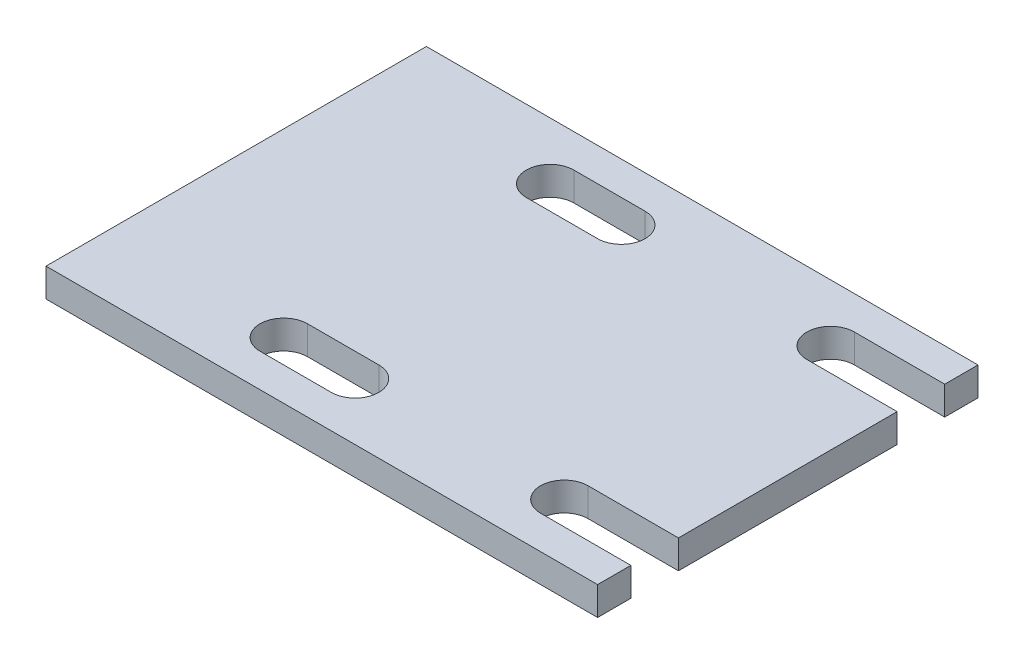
ISO-10303-21;
HEADER;
FILE_DESCRIPTION(('STEP AP214'),'2;1');
FILE_NAME('part.step','',(''),(''),'','','');
FILE_SCHEMA(('AUTOMOTIVE_DESIGN { 1 0 10303 214 1 1 1 1 }'));
ENDSEC;
DATA;
#1=APPLICATION_CONTEXT('core data for automotive mechanical design processes');
#2=APPLICATION_PROTOCOL_DEFINITION('international standard','automotive_design',2000,#1);
#3=PRODUCT_CONTEXT('',#1,'mechanical');
#4=PRODUCT('Part','Part','',(#3));
#5=PRODUCT_RELATED_PRODUCT_CATEGORY('part','',(#4));
#6=PRODUCT_DEFINITION_FORMATION('','',#4);
#7=PRODUCT_DEFINITION_CONTEXT('part definition',#1,'design');
#8=PRODUCT_DEFINITION('design','',#6,#7);
#9=PRODUCT_DEFINITION_SHAPE('','',#8);
#10=(LENGTH_UNIT() NAMED_UNIT(*) SI_UNIT(.MILLI.,.METRE.));
#11=(NAMED_UNIT(*) PLANE_ANGLE_UNIT() SI_UNIT($,.RADIAN.));
#12=(NAMED_UNIT(*) SI_UNIT($,.STERADIAN.) SOLID_ANGLE_UNIT());
#13=UNCERTAINTY_MEASURE_WITH_UNIT(LENGTH_MEASURE(1.E-05),#10,'distance_accuracy_value','');
#14=(GEOMETRIC_REPRESENTATION_CONTEXT(3) GLOBAL_UNCERTAINTY_ASSIGNED_CONTEXT((#13)) GLOBAL_UNIT_ASSIGNED_CONTEXT((#10,
#11,#12)) REPRESENTATION_CONTEXT('',''));
#15=CARTESIAN_POINT('',(0.,0.,0.));
#16=DIRECTION('',(0.,0.,1.));
#17=DIRECTION('',(1.,0.,0.));
#18=AXIS2_PLACEMENT_3D('',#15,#16,#17);
#19=CARTESIAN_POINT('',(368.3,19.05,0.));
#20=DIRECTION('',(-1.,0.,0.));
#21=DIRECTION('',(0.,0.,1.));
#22=AXIS2_PLACEMENT_3D('',#19,#20,#21);
#23=PLANE('',#22);
#24=DIRECTION('',(0.,0.,-1.));
#25=VECTOR('',#24,1.);
#26=CARTESIAN_POINT('',(368.3,19.05,0.));
#27=LINE('',#26,#25);
#28=CARTESIAN_POINT('',(368.3,19.05,-53.975));
#29=VERTEX_POINT('',#28);
#30=CARTESIAN_POINT('',(368.3,19.05,-200.025));
#31=VERTEX_POINT('',#30);
#32=EDGE_CURVE('E358',#29,#31,#27,.T.);
#33=ORIENTED_EDGE('',*,*,#32,.F.);
#34=DIRECTION('',(0.,1.,0.));
#35=VECTOR('',#34,1.);
#36=CARTESIAN_POINT('',(368.3,0.,-53.975));
#37=LINE('',#36,#35);
#38=CARTESIAN_POINT('',(368.3,0.,-53.975));
#39=VERTEX_POINT('',#38);
#40=EDGE_CURVE('E219',#39,#29,#37,.T.);
#41=ORIENTED_EDGE('',*,*,#40,.F.);
#42=DIRECTION('',(0.,0.,-1.));
#43=VECTOR('',#42,1.);
#44=CARTESIAN_POINT('',(368.3,0.,0.));
#45=LINE('',#44,#43);
#46=CARTESIAN_POINT('',(368.3,0.,-200.025));
#47=VERTEX_POINT('',#46);
#48=EDGE_CURVE('E372',#39,#47,#45,.T.);
#49=ORIENTED_EDGE('',*,*,#48,.T.);
#50=DIRECTION('',(0.,1.,0.));
#51=VECTOR('',#50,1.);
#52=CARTESIAN_POINT('',(368.3,0.,-200.025));
#53=LINE('',#52,#51);
#54=EDGE_CURVE('E55',#47,#31,#53,.T.);
#55=ORIENTED_EDGE('',*,*,#54,.T.);
#56=EDGE_LOOP('',(#33,#41,#49,#55));
#57=FACE_BOUND('',#56,.T.);
#58=ADVANCED_FACE('F39',(#57),#23,.F.);
#59=CARTESIAN_POINT('',(368.3,19.05,-231.775));
#60=VERTEX_POINT('',#59);
#61=CARTESIAN_POINT('',(368.3,19.05,-254.));
#62=VERTEX_POINT('',#61);
#63=EDGE_CURVE('E352',#60,#62,#27,.T.);
#64=ORIENTED_EDGE('',*,*,#63,.F.);
#65=DIRECTION('',(0.,1.,0.));
#66=VECTOR('',#65,1.);
#67=CARTESIAN_POINT('',(368.3,0.,-231.775));
#68=LINE('',#67,#66);
#69=CARTESIAN_POINT('',(368.3,0.,-231.775));
#70=VERTEX_POINT('',#69);
#71=EDGE_CURVE('E249',#70,#60,#68,.T.);
#72=ORIENTED_EDGE('',*,*,#71,.F.);
#73=CARTESIAN_POINT('',(368.3,0.,-254.));
#74=VERTEX_POINT('',#73);
#75=EDGE_CURVE('E368',#70,#74,#45,.T.);
#76=ORIENTED_EDGE('',*,*,#75,.T.);
#77=DIRECTION('',(0.,-1.,0.));
#78=VECTOR('',#77,1.);
#79=CARTESIAN_POINT('',(368.3,19.05,-254.));
#80=LINE('',#79,#78);
#81=EDGE_CURVE('E378',#62,#74,#80,.T.);
#82=ORIENTED_EDGE('',*,*,#81,.F.);
#83=EDGE_LOOP('',(#64,#72,#76,#82));
#84=FACE_BOUND('',#83,.T.);
#85=ADVANCED_FACE('F422',(#84),#23,.F.);
#86=CARTESIAN_POINT('',(0.,19.05,0.));
#87=DIRECTION('',(1.,0.,0.));
#88=DIRECTION('',(0.,0.,-1.));
#89=AXIS2_PLACEMENT_3D('',#86,#87,#88);
#90=PLANE('',#89);
#91=DIRECTION('',(0.,0.,1.));
#92=VECTOR('',#91,1.);
#93=CARTESIAN_POINT('',(0.,0.,0.));
#94=LINE('',#93,#92);
#95=CARTESIAN_POINT('',(0.,0.,-254.));
#96=VERTEX_POINT('',#95);
#97=CARTESIAN_POINT('',(0.,0.,0.));
#98=VERTEX_POINT('',#97);
#99=EDGE_CURVE('E292',#96,#98,#94,.T.);
#100=ORIENTED_EDGE('',*,*,#99,.T.);
#101=DIRECTION('',(0.,-1.,0.));
#102=VECTOR('',#101,1.);
#103=CARTESIAN_POINT('',(0.,19.05,0.));
#104=LINE('',#103,#102);
#105=CARTESIAN_POINT('',(0.,19.05,0.));
#106=VERTEX_POINT('',#105);
#107=EDGE_CURVE('E11',#106,#98,#104,.T.);
#108=ORIENTED_EDGE('',*,*,#107,.F.);
#109=DIRECTION('',(0.,0.,1.));
#110=VECTOR('',#109,1.);
#111=CARTESIAN_POINT('',(0.,19.05,0.));
#112=LINE('',#111,#110);
#113=CARTESIAN_POINT('',(0.,19.05,-254.));
#114=VERTEX_POINT('',#113);
#115=EDGE_CURVE('E344',#114,#106,#112,.T.);
#116=ORIENTED_EDGE('',*,*,#115,.F.);
#117=DIRECTION('',(0.,-1.,0.));
#118=VECTOR('',#117,1.);
#119=CARTESIAN_POINT('',(0.,19.05,-254.));
#120=LINE('',#119,#118);
#121=EDGE_CURVE('E361',#114,#96,#120,.T.);
#122=ORIENTED_EDGE('',*,*,#121,.T.);
#123=EDGE_LOOP('',(#100,#108,#116,#122));
#124=FACE_BOUND('',#123,.T.);
#125=ADVANCED_FACE('F41',(#124),#90,.F.);
#126=CARTESIAN_POINT('',(0.,19.05,0.));
#127=DIRECTION('',(0.,0.,-1.));
#128=DIRECTION('',(-1.,0.,0.));
#129=AXIS2_PLACEMENT_3D('',#126,#127,#128);
#130=PLANE('',#129);
#131=DIRECTION('',(1.,0.,0.));
#132=VECTOR('',#131,1.);
#133=CARTESIAN_POINT('',(0.,0.,0.));
#134=LINE('',#133,#132);
#135=CARTESIAN_POINT('',(368.3,0.,0.));
#136=VERTEX_POINT('',#135);
#137=EDGE_CURVE('E365',#98,#136,#134,.T.);
#138=ORIENTED_EDGE('',*,*,#137,.T.);
#139=DIRECTION('',(0.,-1.,0.));
#140=VECTOR('',#139,1.);
#141=CARTESIAN_POINT('',(368.3,19.05,0.));
#142=LINE('',#141,#140);
#143=CARTESIAN_POINT('',(368.3,19.05,0.));
#144=VERTEX_POINT('',#143);
#145=EDGE_CURVE('E48',#144,#136,#142,.T.);
#146=ORIENTED_EDGE('',*,*,#145,.F.);
#147=DIRECTION('',(1.,0.,0.));
#148=VECTOR('',#147,1.);
#149=CARTESIAN_POINT('',(0.,19.05,0.));
#150=LINE('',#149,#148);
#151=EDGE_CURVE('E348',#106,#144,#150,.T.);
#152=ORIENTED_EDGE('',*,*,#151,.F.);
#153=ORIENTED_EDGE('',*,*,#107,.T.);
#154=EDGE_LOOP('',(#138,#146,#152,#153));
#155=FACE_BOUND('',#154,.T.);
#156=ADVANCED_FACE('F391',(#155),#130,.F.);
#157=CARTESIAN_POINT('',(368.3,0.,-22.225));
#158=VERTEX_POINT('',#157);
#159=EDGE_CURVE('E369',#136,#158,#45,.T.);
#160=ORIENTED_EDGE('',*,*,#159,.T.);
#161=DIRECTION('',(0.,1.,0.));
#162=VECTOR('',#161,1.);
#163=CARTESIAN_POINT('',(368.3,0.,-22.225));
#164=LINE('',#163,#162);
#165=CARTESIAN_POINT('',(368.3,19.05,-22.225));
#166=VERTEX_POINT('',#165);
#167=EDGE_CURVE('E63',#158,#166,#164,.T.);
#168=ORIENTED_EDGE('',*,*,#167,.T.);
#169=EDGE_CURVE('E353',#144,#166,#27,.T.);
#170=ORIENTED_EDGE('',*,*,#169,.F.);
#171=ORIENTED_EDGE('',*,*,#145,.T.);
#172=EDGE_LOOP('',(#160,#168,#170,#171));
#173=FACE_BOUND('',#172,.T.);
#174=ADVANCED_FACE('F386',(#173),#23,.F.);
#175=CARTESIAN_POINT('',(0.,19.05,-254.));
#176=DIRECTION('',(0.,0.,1.));
#177=DIRECTION('',(1.,0.,0.));
#178=AXIS2_PLACEMENT_3D('',#175,#176,#177);
#179=PLANE('',#178);
#180=DIRECTION('',(-1.,0.,0.));
#181=VECTOR('',#180,1.);
#182=CARTESIAN_POINT('',(0.,0.,-254.));
#183=LINE('',#182,#181);
#184=EDGE_CURVE('E349',#74,#96,#183,.T.);
#185=ORIENTED_EDGE('',*,*,#184,.T.);
#186=ORIENTED_EDGE('',*,*,#121,.F.);
#187=DIRECTION('',(-1.,0.,0.));
#188=VECTOR('',#187,1.);
#189=CARTESIAN_POINT('',(0.,19.05,-254.));
#190=LINE('',#189,#188);
#191=EDGE_CURVE('E357',#62,#114,#190,.T.);
#192=ORIENTED_EDGE('',*,*,#191,.F.);
#193=ORIENTED_EDGE('',*,*,#81,.T.);
#194=EDGE_LOOP('',(#185,#186,#192,#193));
#195=FACE_BOUND('',#194,.T.);
#196=ADVANCED_FACE('F397',(#195),#179,.F.);
#197=CARTESIAN_POINT('',(0.,19.05,0.));
#198=DIRECTION('',(0.,-1.,0.));
#199=DIRECTION('',(0.,0.,-1.));
#200=AXIS2_PLACEMENT_3D('',#197,#198,#199);
#201=PLANE('',#200);
#202=DIRECTION('',(1.,0.,0.));
#203=VECTOR('',#202,1.);
#204=CARTESIAN_POINT('',(168.275,19.05,-22.225));
#205=LINE('',#204,#203);
#206=CARTESIAN_POINT('',(120.65,19.05,-22.225));
#207=VERTEX_POINT('',#206);
#208=CARTESIAN_POINT('',(168.275,19.05,-22.225));
#209=VERTEX_POINT('',#208);
#210=EDGE_CURVE('E277',#207,#209,#205,.T.);
#211=ORIENTED_EDGE('',*,*,#210,.F.);
#212=CARTESIAN_POINT('',(120.65,19.05,-38.1));
#213=DIRECTION('',(0.,1.,0.));
#214=DIRECTION('',(0.,0.,1.));
#215=AXIS2_PLACEMENT_3D('',#212,#213,#214);
#216=CIRCLE('',#215,15.875);
#217=CARTESIAN_POINT('',(120.65,19.05,-53.975));
#218=VERTEX_POINT('',#217);
#219=EDGE_CURVE('E274',#218,#207,#216,.T.);
#220=ORIENTED_EDGE('',*,*,#219,.F.);
#221=DIRECTION('',(-1.,0.,0.));
#222=VECTOR('',#221,1.);
#223=CARTESIAN_POINT('',(120.65,19.05,-53.975));
#224=LINE('',#223,#222);
#225=CARTESIAN_POINT('',(168.275,19.05,-53.975));
#226=VERTEX_POINT('',#225);
#227=EDGE_CURVE('E261',#226,#218,#224,.T.);
#228=ORIENTED_EDGE('',*,*,#227,.F.);
#229=CARTESIAN_POINT('',(168.275,19.05,-38.1));
#230=DIRECTION('',(0.,1.,0.));
#231=DIRECTION('',(0.,0.,1.));
#232=AXIS2_PLACEMENT_3D('',#229,#230,#231);
#233=CIRCLE('',#232,15.875);
#234=EDGE_CURVE('E282',#209,#226,#233,.T.);
#235=ORIENTED_EDGE('',*,*,#234,.F.);
#236=EDGE_LOOP('',(#211,#220,#228,#235));
#237=FACE_BOUND('',#236,.T.);
#238=DIRECTION('',(1.,0.,0.));
#239=VECTOR('',#238,1.);
#240=CARTESIAN_POINT('',(120.65,19.05,-200.025));
#241=LINE('',#240,#239);
#242=CARTESIAN_POINT('',(120.65,19.05,-200.025));
#243=VERTEX_POINT('',#242);
#244=CARTESIAN_POINT('',(168.275,19.05,-200.025));
#245=VERTEX_POINT('',#244);
#246=EDGE_CURVE('E322',#243,#245,#241,.T.);
#247=ORIENTED_EDGE('',*,*,#246,.F.);
#248=CARTESIAN_POINT('',(120.65,19.05,-215.9));
#249=DIRECTION('',(0.,1.,0.));
#250=DIRECTION('',(0.,0.,-1.));
#251=AXIS2_PLACEMENT_3D('',#248,#249,#250);
#252=CIRCLE('',#251,15.875);
#253=CARTESIAN_POINT('',(120.65,19.05,-231.775));
#254=VERTEX_POINT('',#253);
#255=EDGE_CURVE('E218',#254,#243,#252,.T.);
#256=ORIENTED_EDGE('',*,*,#255,.F.);
#257=DIRECTION('',(-1.,0.,0.));
#258=VECTOR('',#257,1.);
#259=CARTESIAN_POINT('',(168.275,19.05,-231.775));
#260=LINE('',#259,#258);
#261=CARTESIAN_POINT('',(168.275,19.05,-231.775));
#262=VERTEX_POINT('',#261);
#263=EDGE_CURVE('E307',#262,#254,#260,.T.);
#264=ORIENTED_EDGE('',*,*,#263,.F.);
#265=CARTESIAN_POINT('',(168.275,19.05,-215.9));
#266=DIRECTION('',(0.,1.,0.));
#267=DIRECTION('',(0.,0.,-1.));
#268=AXIS2_PLACEMENT_3D('',#265,#266,#267);
#269=CIRCLE('',#268,15.875);
#270=EDGE_CURVE('E326',#245,#262,#269,.T.);
#271=ORIENTED_EDGE('',*,*,#270,.F.);
#272=EDGE_LOOP('',(#247,#256,#264,#271));
#273=FACE_BOUND('',#272,.T.);
#274=CARTESIAN_POINT('',(307.975,19.05,-38.1));
#275=DIRECTION('',(0.,1.,0.));
#276=DIRECTION('',(0.,0.,1.));
#277=AXIS2_PLACEMENT_3D('',#274,#275,#276);
#278=CIRCLE('',#277,15.875);
#279=CARTESIAN_POINT('',(307.975,19.05,-53.975));
#280=VERTEX_POINT('',#279);
#281=CARTESIAN_POINT('',(307.975,19.05,-22.225));
#282=VERTEX_POINT('',#281);
#283=EDGE_CURVE('E185',#280,#282,#278,.T.);
#284=ORIENTED_EDGE('',*,*,#283,.F.);
#285=DIRECTION('',(-1.,0.,0.));
#286=VECTOR('',#285,1.);
#287=CARTESIAN_POINT('',(307.975,19.05,-53.975));
#288=LINE('',#287,#286);
#289=EDGE_CURVE('E201',#29,#280,#288,.T.);
#290=ORIENTED_EDGE('',*,*,#289,.F.);
#291=ORIENTED_EDGE('',*,*,#32,.T.);
#292=DIRECTION('',(1.,0.,0.));
#293=VECTOR('',#292,1.);
#294=CARTESIAN_POINT('',(307.975,19.05,-200.025));
#295=LINE('',#294,#293);
#296=CARTESIAN_POINT('',(307.975,19.05,-200.025));
#297=VERTEX_POINT('',#296);
#298=EDGE_CURVE('E241',#297,#31,#295,.T.);
#299=ORIENTED_EDGE('',*,*,#298,.F.);
#300=CARTESIAN_POINT('',(307.975,19.05,-215.9));
#301=DIRECTION('',(0.,1.,0.));
#302=DIRECTION('',(0.,0.,-1.));
#303=AXIS2_PLACEMENT_3D('',#300,#301,#302);
#304=CIRCLE('',#303,15.875);
#305=CARTESIAN_POINT('',(307.975,19.05,-231.775));
#306=VERTEX_POINT('',#305);
#307=EDGE_CURVE('E237',#306,#297,#304,.T.);
#308=ORIENTED_EDGE('',*,*,#307,.F.);
#309=DIRECTION('',(-1.,0.,0.));
#310=VECTOR('',#309,1.);
#311=CARTESIAN_POINT('',(307.975,19.05,-231.775));
#312=LINE('',#311,#310);
#313=EDGE_CURVE('E229',#60,#306,#312,.T.);
#314=ORIENTED_EDGE('',*,*,#313,.F.);
#315=ORIENTED_EDGE('',*,*,#63,.T.);
#316=ORIENTED_EDGE('',*,*,#191,.T.);
#317=ORIENTED_EDGE('',*,*,#115,.T.);
#318=ORIENTED_EDGE('',*,*,#151,.T.);
#319=ORIENTED_EDGE('',*,*,#169,.T.);
#320=DIRECTION('',(1.,0.,0.));
#321=VECTOR('',#320,1.);
#322=CARTESIAN_POINT('',(307.975,19.05,-22.225));
#323=LINE('',#322,#321);
#324=EDGE_CURVE('E205',#282,#166,#323,.T.);
#325=ORIENTED_EDGE('',*,*,#324,.F.);
#326=EDGE_LOOP('',(#284,#290,#291,#299,#308,#314,#315,#316,#317,#318,#319,#325));
#327=FACE_BOUND('',#326,.T.);
#328=ADVANCED_FACE('F417',(#237,#273,#327),#201,.F.);
#329=CARTESIAN_POINT('',(0.,0.,0.));
#330=DIRECTION('',(0.,-1.,0.));
#331=DIRECTION('',(0.,0.,-1.));
#332=AXIS2_PLACEMENT_3D('',#329,#330,#331);
#333=PLANE('',#332);
#334=DIRECTION('',(-1.,0.,0.));
#335=VECTOR('',#334,1.);
#336=CARTESIAN_POINT('',(307.975,0.,-53.975));
#337=LINE('',#336,#335);
#338=CARTESIAN_POINT('',(307.975,0.,-53.975));
#339=VERTEX_POINT('',#338);
#340=EDGE_CURVE('E188',#39,#339,#337,.T.);
#341=ORIENTED_EDGE('',*,*,#340,.T.);
#342=CARTESIAN_POINT('',(307.975,0.,-38.1));
#343=DIRECTION('',(0.,1.,0.));
#344=DIRECTION('',(0.,0.,1.));
#345=AXIS2_PLACEMENT_3D('',#342,#343,#344);
#346=CIRCLE('',#345,15.875);
#347=CARTESIAN_POINT('',(307.975,0.,-22.225));
#348=VERTEX_POINT('',#347);
#349=EDGE_CURVE('E182',#339,#348,#346,.T.);
#350=ORIENTED_EDGE('',*,*,#349,.T.);
#351=DIRECTION('',(1.,0.,0.));
#352=VECTOR('',#351,1.);
#353=CARTESIAN_POINT('',(307.975,0.,-22.225));
#354=LINE('',#353,#352);
#355=EDGE_CURVE('E190',#348,#158,#354,.T.);
#356=ORIENTED_EDGE('',*,*,#355,.T.);
#357=ORIENTED_EDGE('',*,*,#159,.F.);
#358=ORIENTED_EDGE('',*,*,#137,.F.);
#359=ORIENTED_EDGE('',*,*,#99,.F.);
#360=ORIENTED_EDGE('',*,*,#184,.F.);
#361=ORIENTED_EDGE('',*,*,#75,.F.);
#362=DIRECTION('',(-1.,0.,0.));
#363=VECTOR('',#362,1.);
#364=CARTESIAN_POINT('',(307.975,0.,-231.775));
#365=LINE('',#364,#363);
#366=CARTESIAN_POINT('',(307.975,0.,-231.775));
#367=VERTEX_POINT('',#366);
#368=EDGE_CURVE('E232',#70,#367,#365,.T.);
#369=ORIENTED_EDGE('',*,*,#368,.T.);
#370=CARTESIAN_POINT('',(307.975,0.,-215.9));
#371=DIRECTION('',(0.,1.,0.));
#372=DIRECTION('',(0.,0.,-1.));
#373=AXIS2_PLACEMENT_3D('',#370,#371,#372);
#374=CIRCLE('',#373,15.875);
#375=CARTESIAN_POINT('',(307.975,0.,-200.025));
#376=VERTEX_POINT('',#375);
#377=EDGE_CURVE('E224',#367,#376,#374,.T.);
#378=ORIENTED_EDGE('',*,*,#377,.T.);
#379=DIRECTION('',(1.,0.,0.));
#380=VECTOR('',#379,1.);
#381=CARTESIAN_POINT('',(307.975,0.,-200.025));
#382=LINE('',#381,#380);
#383=EDGE_CURVE('E228',#376,#47,#382,.T.);
#384=ORIENTED_EDGE('',*,*,#383,.T.);
#385=ORIENTED_EDGE('',*,*,#48,.F.);
#386=EDGE_LOOP('',(#341,#350,#356,#357,#358,#359,#360,#361,#369,#378,#384,#385));
#387=FACE_BOUND('',#386,.T.);
#388=CARTESIAN_POINT('',(120.65,0.,-38.1));
#389=DIRECTION('',(0.,1.,0.));
#390=DIRECTION('',(0.,0.,1.));
#391=AXIS2_PLACEMENT_3D('',#388,#389,#390);
#392=CIRCLE('',#391,15.875);
#393=CARTESIAN_POINT('',(120.65,0.,-53.975));
#394=VERTEX_POINT('',#393);
#395=CARTESIAN_POINT('',(120.65,0.,-22.225));
#396=VERTEX_POINT('',#395);
#397=EDGE_CURVE('E256',#394,#396,#392,.T.);
#398=ORIENTED_EDGE('',*,*,#397,.T.);
#399=DIRECTION('',(1.,0.,0.));
#400=VECTOR('',#399,1.);
#401=CARTESIAN_POINT('',(168.275,0.,-22.225));
#402=LINE('',#401,#400);
#403=CARTESIAN_POINT('',(168.275,0.,-22.225));
#404=VERTEX_POINT('',#403);
#405=EDGE_CURVE('E260',#396,#404,#402,.T.);
#406=ORIENTED_EDGE('',*,*,#405,.T.);
#407=CARTESIAN_POINT('',(168.275,0.,-38.1));
#408=DIRECTION('',(0.,1.,0.));
#409=DIRECTION('',(0.,0.,1.));
#410=AXIS2_PLACEMENT_3D('',#407,#408,#409);
#411=CIRCLE('',#410,15.875);
#412=CARTESIAN_POINT('',(168.275,0.,-53.975));
#413=VERTEX_POINT('',#412);
#414=EDGE_CURVE('E265',#404,#413,#411,.T.);
#415=ORIENTED_EDGE('',*,*,#414,.T.);
#416=DIRECTION('',(-1.,0.,0.));
#417=VECTOR('',#416,1.);
#418=CARTESIAN_POINT('',(120.65,0.,-53.975));
#419=LINE('',#418,#417);
#420=EDGE_CURVE('E269',#413,#394,#419,.T.);
#421=ORIENTED_EDGE('',*,*,#420,.T.);
#422=EDGE_LOOP('',(#398,#406,#415,#421));
#423=FACE_BOUND('',#422,.T.);
#424=CARTESIAN_POINT('',(120.65,0.,-215.9));
#425=DIRECTION('',(0.,1.,0.));
#426=DIRECTION('',(0.,0.,-1.));
#427=AXIS2_PLACEMENT_3D('',#424,#425,#426);
#428=CIRCLE('',#427,15.875);
#429=CARTESIAN_POINT('',(120.65,0.,-231.775));
#430=VERTEX_POINT('',#429);
#431=CARTESIAN_POINT('',(120.65,0.,-200.025));
#432=VERTEX_POINT('',#431);
#433=EDGE_CURVE('E302',#430,#432,#428,.T.);
#434=ORIENTED_EDGE('',*,*,#433,.T.);
#435=DIRECTION('',(1.,0.,0.));
#436=VECTOR('',#435,1.);
#437=CARTESIAN_POINT('',(120.65,0.,-200.025));
#438=LINE('',#437,#436);
#439=CARTESIAN_POINT('',(168.275,0.,-200.025));
#440=VERTEX_POINT('',#439);
#441=EDGE_CURVE('E306',#432,#440,#438,.T.);
#442=ORIENTED_EDGE('',*,*,#441,.T.);
#443=CARTESIAN_POINT('',(168.275,0.,-215.9));
#444=DIRECTION('',(0.,1.,0.));
#445=DIRECTION('',(0.,0.,-1.));
#446=AXIS2_PLACEMENT_3D('',#443,#444,#445);
#447=CIRCLE('',#446,15.875);
#448=CARTESIAN_POINT('',(168.275,0.,-231.775));
#449=VERTEX_POINT('',#448);
#450=EDGE_CURVE('E311',#440,#449,#447,.T.);
#451=ORIENTED_EDGE('',*,*,#450,.T.);
#452=DIRECTION('',(-1.,0.,0.));
#453=VECTOR('',#452,1.);
#454=CARTESIAN_POINT('',(168.275,0.,-231.775));
#455=LINE('',#454,#453);
#456=EDGE_CURVE('E315',#449,#430,#455,.T.);
#457=ORIENTED_EDGE('',*,*,#456,.T.);
#458=EDGE_LOOP('',(#434,#442,#451,#457));
#459=FACE_BOUND('',#458,.T.);
#460=ADVANCED_FACE('F197',(#387,#423,#459),#333,.T.);
#461=CARTESIAN_POINT('',(120.65,0.,-215.9));
#462=DIRECTION('',(0.,1.,0.));
#463=DIRECTION('',(0.,0.,1.));
#464=AXIS2_PLACEMENT_3D('',#461,#462,#463);
#465=CYLINDRICAL_SURFACE('',#464,15.875);
#466=ORIENTED_EDGE('',*,*,#255,.T.);
#467=DIRECTION('',(0.,1.,0.));
#468=VECTOR('',#467,1.);
#469=CARTESIAN_POINT('',(120.65,0.,-200.025));
#470=LINE('',#469,#468);
#471=EDGE_CURVE('E319',#432,#243,#470,.T.);
#472=ORIENTED_EDGE('',*,*,#471,.F.);
#473=ORIENTED_EDGE('',*,*,#433,.F.);
#474=DIRECTION('',(0.,1.,0.));
#475=VECTOR('',#474,1.);
#476=CARTESIAN_POINT('',(120.65,0.,-231.775));
#477=LINE('',#476,#475);
#478=EDGE_CURVE('E278',#430,#254,#477,.T.);
#479=ORIENTED_EDGE('',*,*,#478,.T.);
#480=EDGE_LOOP('',(#466,#472,#473,#479));
#481=FACE_BOUND('',#480,.T.);
#482=ADVANCED_FACE('F471',(#481),#465,.F.);
#483=CARTESIAN_POINT('',(168.275,0.,-231.775));
#484=DIRECTION('',(0.,0.,-1.));
#485=DIRECTION('',(-1.,0.,0.));
#486=AXIS2_PLACEMENT_3D('',#483,#484,#485);
#487=PLANE('',#486);
#488=ORIENTED_EDGE('',*,*,#263,.T.);
#489=ORIENTED_EDGE('',*,*,#478,.F.);
#490=ORIENTED_EDGE('',*,*,#456,.F.);
#491=DIRECTION('',(0.,1.,0.));
#492=VECTOR('',#491,1.);
#493=CARTESIAN_POINT('',(168.275,0.,-231.775));
#494=LINE('',#493,#492);
#495=EDGE_CURVE('E335',#449,#262,#494,.T.);
#496=ORIENTED_EDGE('',*,*,#495,.T.);
#497=EDGE_LOOP('',(#488,#489,#490,#496));
#498=FACE_BOUND('',#497,.T.);
#499=ADVANCED_FACE('F479',(#498),#487,.F.);
#500=CARTESIAN_POINT('',(168.275,0.,-215.9));
#501=DIRECTION('',(0.,1.,0.));
#502=DIRECTION('',(0.,0.,1.));
#503=AXIS2_PLACEMENT_3D('',#500,#501,#502);
#504=CYLINDRICAL_SURFACE('',#503,15.875);
#505=ORIENTED_EDGE('',*,*,#270,.T.);
#506=ORIENTED_EDGE('',*,*,#495,.F.);
#507=ORIENTED_EDGE('',*,*,#450,.F.);
#508=DIRECTION('',(0.,1.,0.));
#509=VECTOR('',#508,1.);
#510=CARTESIAN_POINT('',(168.275,0.,-200.025));
#511=LINE('',#510,#509);
#512=EDGE_CURVE('E338',#440,#245,#511,.T.);
#513=ORIENTED_EDGE('',*,*,#512,.T.);
#514=EDGE_LOOP('',(#505,#506,#507,#513));
#515=FACE_BOUND('',#514,.T.);
#516=ADVANCED_FACE('F488',(#515),#504,.F.);
#517=CARTESIAN_POINT('',(120.65,0.,-200.025));
#518=DIRECTION('',(0.,0.,1.));
#519=DIRECTION('',(1.,0.,0.));
#520=AXIS2_PLACEMENT_3D('',#517,#518,#519);
#521=PLANE('',#520);
#522=ORIENTED_EDGE('',*,*,#246,.T.);
#523=ORIENTED_EDGE('',*,*,#512,.F.);
#524=ORIENTED_EDGE('',*,*,#441,.F.);
#525=ORIENTED_EDGE('',*,*,#471,.T.);
#526=EDGE_LOOP('',(#522,#523,#524,#525));
#527=FACE_BOUND('',#526,.T.);
#528=ADVANCED_FACE('F497',(#527),#521,.F.);
#529=CARTESIAN_POINT('',(120.65,0.,-38.1));
#530=DIRECTION('',(0.,1.,0.));
#531=DIRECTION('',(0.,0.,1.));
#532=AXIS2_PLACEMENT_3D('',#529,#530,#531);
#533=CYLINDRICAL_SURFACE('',#532,15.875);
#534=ORIENTED_EDGE('',*,*,#219,.T.);
#535=DIRECTION('',(0.,1.,0.));
#536=VECTOR('',#535,1.);
#537=CARTESIAN_POINT('',(120.65,0.,-22.225));
#538=LINE('',#537,#536);
#539=EDGE_CURVE('E273',#396,#207,#538,.T.);
#540=ORIENTED_EDGE('',*,*,#539,.F.);
#541=ORIENTED_EDGE('',*,*,#397,.F.);
#542=DIRECTION('',(0.,1.,0.));
#543=VECTOR('',#542,1.);
#544=CARTESIAN_POINT('',(120.65,0.,-53.975));
#545=LINE('',#544,#543);
#546=EDGE_CURVE('E289',#394,#218,#545,.T.);
#547=ORIENTED_EDGE('',*,*,#546,.T.);
#548=EDGE_LOOP('',(#534,#540,#541,#547));
#549=FACE_BOUND('',#548,.T.);
#550=ADVANCED_FACE('F506',(#549),#533,.F.);
#551=CARTESIAN_POINT('',(120.65,0.,-53.975));
#552=DIRECTION('',(0.,0.,-1.));
#553=DIRECTION('',(-1.,0.,0.));
#554=AXIS2_PLACEMENT_3D('',#551,#552,#553);
#555=PLANE('',#554);
#556=ORIENTED_EDGE('',*,*,#227,.T.);
#557=ORIENTED_EDGE('',*,*,#546,.F.);
#558=ORIENTED_EDGE('',*,*,#420,.F.);
#559=DIRECTION('',(0.,1.,0.));
#560=VECTOR('',#559,1.);
#561=CARTESIAN_POINT('',(168.275,0.,-53.975));
#562=LINE('',#561,#560);
#563=EDGE_CURVE('E293',#413,#226,#562,.T.);
#564=ORIENTED_EDGE('',*,*,#563,.T.);
#565=EDGE_LOOP('',(#556,#557,#558,#564));
#566=FACE_BOUND('',#565,.T.);
#567=ADVANCED_FACE('F515',(#566),#555,.F.);
#568=CARTESIAN_POINT('',(168.275,0.,-38.1));
#569=DIRECTION('',(0.,1.,0.));
#570=DIRECTION('',(0.,0.,1.));
#571=AXIS2_PLACEMENT_3D('',#568,#569,#570);
#572=CYLINDRICAL_SURFACE('',#571,15.875);
#573=ORIENTED_EDGE('',*,*,#234,.T.);
#574=ORIENTED_EDGE('',*,*,#563,.F.);
#575=ORIENTED_EDGE('',*,*,#414,.F.);
#576=DIRECTION('',(0.,1.,0.));
#577=VECTOR('',#576,1.);
#578=CARTESIAN_POINT('',(168.275,0.,-22.225));
#579=LINE('',#578,#577);
#580=EDGE_CURVE('E296',#404,#209,#579,.T.);
#581=ORIENTED_EDGE('',*,*,#580,.T.);
#582=EDGE_LOOP('',(#573,#574,#575,#581));
#583=FACE_BOUND('',#582,.T.);
#584=ADVANCED_FACE('F524',(#583),#572,.F.);
#585=CARTESIAN_POINT('',(168.275,0.,-22.225));
#586=DIRECTION('',(0.,0.,1.));
#587=DIRECTION('',(1.,0.,0.));
#588=AXIS2_PLACEMENT_3D('',#585,#586,#587);
#589=PLANE('',#588);
#590=ORIENTED_EDGE('',*,*,#210,.T.);
#591=ORIENTED_EDGE('',*,*,#580,.F.);
#592=ORIENTED_EDGE('',*,*,#405,.F.);
#593=ORIENTED_EDGE('',*,*,#539,.T.);
#594=EDGE_LOOP('',(#590,#591,#592,#593));
#595=FACE_BOUND('',#594,.T.);
#596=ADVANCED_FACE('F533',(#595),#589,.F.);
#597=CARTESIAN_POINT('',(307.975,0.,-215.9));
#598=DIRECTION('',(0.,1.,0.));
#599=DIRECTION('',(0.,0.,1.));
#600=AXIS2_PLACEMENT_3D('',#597,#598,#599);
#601=CYLINDRICAL_SURFACE('',#600,15.875);
#602=ORIENTED_EDGE('',*,*,#307,.T.);
#603=DIRECTION('',(0.,1.,0.));
#604=VECTOR('',#603,1.);
#605=CARTESIAN_POINT('',(307.975,0.,-200.025));
#606=LINE('',#605,#604);
#607=EDGE_CURVE('E236',#376,#297,#606,.T.);
#608=ORIENTED_EDGE('',*,*,#607,.F.);
#609=ORIENTED_EDGE('',*,*,#377,.F.);
#610=DIRECTION('',(0.,1.,0.));
#611=VECTOR('',#610,1.);
#612=CARTESIAN_POINT('',(307.975,0.,-231.775));
#613=LINE('',#612,#611);
#614=EDGE_CURVE('E212',#367,#306,#613,.T.);
#615=ORIENTED_EDGE('',*,*,#614,.T.);
#616=EDGE_LOOP('',(#602,#608,#609,#615));
#617=FACE_BOUND('',#616,.T.);
#618=ADVANCED_FACE('F414',(#617),#601,.F.);
#619=CARTESIAN_POINT('',(307.975,0.,-231.775));
#620=DIRECTION('',(0.,0.,-1.));
#621=DIRECTION('',(-1.,0.,0.));
#622=AXIS2_PLACEMENT_3D('',#619,#620,#621);
#623=PLANE('',#622);
#624=ORIENTED_EDGE('',*,*,#313,.T.);
#625=ORIENTED_EDGE('',*,*,#614,.F.);
#626=ORIENTED_EDGE('',*,*,#368,.F.);
#627=ORIENTED_EDGE('',*,*,#71,.T.);
#628=EDGE_LOOP('',(#624,#625,#626,#627));
#629=FACE_BOUND('',#628,.T.);
#630=ADVANCED_FACE('F558',(#629),#623,.F.);
#631=CARTESIAN_POINT('',(307.975,0.,-200.025));
#632=DIRECTION('',(0.,0.,1.));
#633=DIRECTION('',(1.,0.,0.));
#634=AXIS2_PLACEMENT_3D('',#631,#632,#633);
#635=PLANE('',#634);
#636=ORIENTED_EDGE('',*,*,#298,.T.);
#637=ORIENTED_EDGE('',*,*,#54,.F.);
#638=ORIENTED_EDGE('',*,*,#383,.F.);
#639=ORIENTED_EDGE('',*,*,#607,.T.);
#640=EDGE_LOOP('',(#636,#637,#638,#639));
#641=FACE_BOUND('',#640,.T.);
#642=ADVANCED_FACE('F410',(#641),#635,.F.);
#643=CARTESIAN_POINT('',(307.975,0.,-38.1));
#644=DIRECTION('',(0.,1.,0.));
#645=DIRECTION('',(0.,0.,1.));
#646=AXIS2_PLACEMENT_3D('',#643,#644,#645);
#647=CYLINDRICAL_SURFACE('',#646,15.875);
#648=ORIENTED_EDGE('',*,*,#283,.T.);
#649=DIRECTION('',(0.,1.,0.));
#650=VECTOR('',#649,1.);
#651=CARTESIAN_POINT('',(307.975,0.,-22.225));
#652=LINE('',#651,#650);
#653=EDGE_CURVE('E179',#348,#282,#652,.T.);
#654=ORIENTED_EDGE('',*,*,#653,.F.);
#655=ORIENTED_EDGE('',*,*,#349,.F.);
#656=DIRECTION('',(0.,1.,0.));
#657=VECTOR('',#656,1.);
#658=CARTESIAN_POINT('',(307.975,0.,-53.975));
#659=LINE('',#658,#657);
#660=EDGE_CURVE('E215',#339,#280,#659,.T.);
#661=ORIENTED_EDGE('',*,*,#660,.T.);
#662=EDGE_LOOP('',(#648,#654,#655,#661));
#663=FACE_BOUND('',#662,.T.);
#664=ADVANCED_FACE('F180',(#663),#647,.F.);
#665=CARTESIAN_POINT('',(307.975,0.,-53.975));
#666=DIRECTION('',(0.,0.,-1.));
#667=DIRECTION('',(-1.,0.,0.));
#668=AXIS2_PLACEMENT_3D('',#665,#666,#667);
#669=PLANE('',#668);
#670=ORIENTED_EDGE('',*,*,#289,.T.);
#671=ORIENTED_EDGE('',*,*,#660,.F.);
#672=ORIENTED_EDGE('',*,*,#340,.F.);
#673=ORIENTED_EDGE('',*,*,#40,.T.);
#674=EDGE_LOOP('',(#670,#671,#672,#673));
#675=FACE_BOUND('',#674,.T.);
#676=ADVANCED_FACE('F581',(#675),#669,.F.);
#677=CARTESIAN_POINT('',(307.975,0.,-22.225));
#678=DIRECTION('',(0.,0.,1.));
#679=DIRECTION('',(1.,0.,0.));
#680=AXIS2_PLACEMENT_3D('',#677,#678,#679);
#681=PLANE('',#680);
#682=ORIENTED_EDGE('',*,*,#324,.T.);
#683=ORIENTED_EDGE('',*,*,#167,.F.);
#684=ORIENTED_EDGE('',*,*,#355,.F.);
#685=ORIENTED_EDGE('',*,*,#653,.T.);
#686=EDGE_LOOP('',(#682,#683,#684,#685));
#687=FACE_BOUND('',#686,.T.);
#688=ADVANCED_FACE('F191',(#687),#681,.F.);
#689=CLOSED_SHELL('',(#58,#85,#125,#156,#174,#196,#328,#460,#482,#499,#516,#528,#550,#567,#584,
#596,#618,#630,#642,#664,#676,#688));
#690=MANIFOLD_SOLID_BREP('B2',#689);
#691=ADVANCED_BREP_SHAPE_REPRESENTATION('',(#18,#690),#14);
#692=SHAPE_DEFINITION_REPRESENTATION(#9,#691);
ENDSEC;
END-ISO-10303-21;
